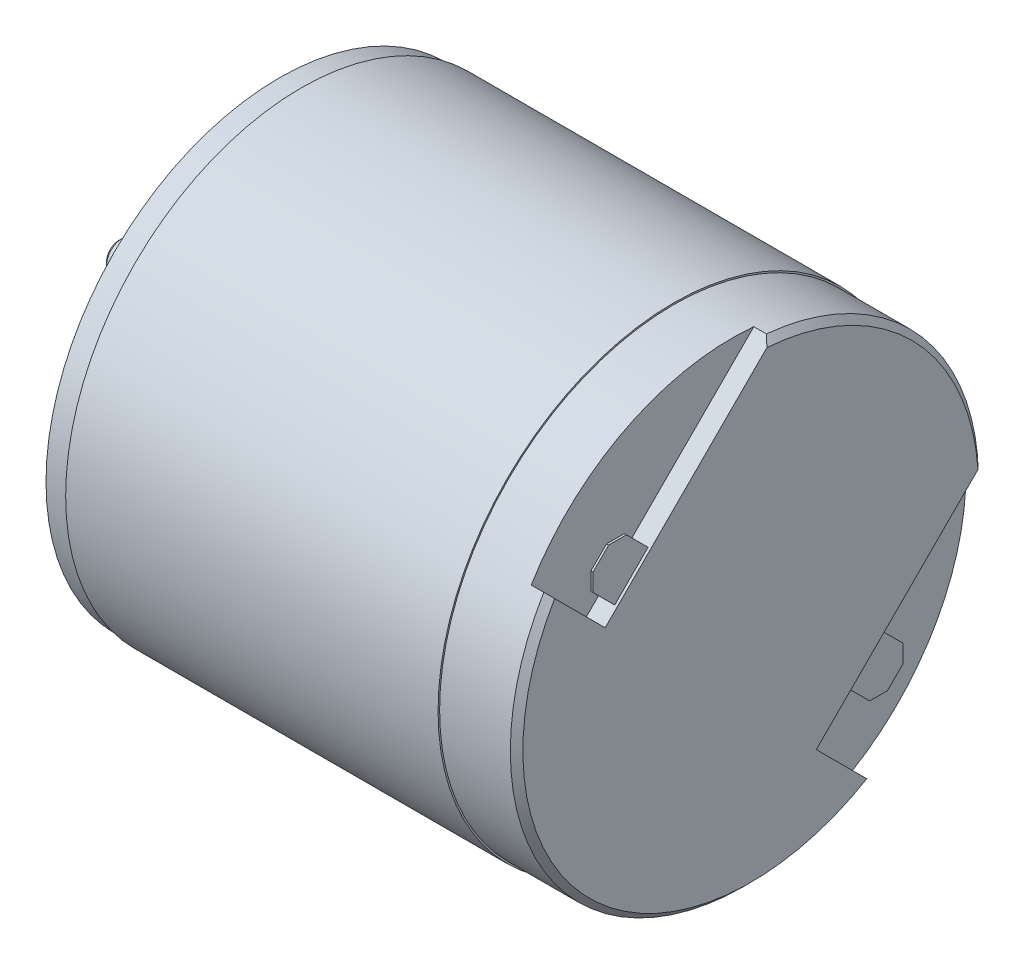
from build123d import *

# Parameters (mm, degrees)
ENL_V_START             = -1.2
ENL_V_MAT_EXTRU_2_DEPTH = 1.2
CHANFREIN1_SIZE         = 0.2
EXTRUSION1_DEPTH        = 0.13
CHANFREIN2_SIZE         = 0.8
CHANFREIN3_SIZE         = 0.4
CHANFREIN4_SIZE         = 0.2
CHANFREIN4_SIZE2        = 0.115470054


with BuildPart() as part:
    # Esquisse1 → R_volution1 (revolve)
    with BuildSketch(Plane.XY, mode=Mode.PRIVATE) as r_volution1_sk:
        Polygon((0, 0), (0, 14.9), (-4.9, 14.9), (-4.9, 15), (-28.6, 15), (-28.6, 14.85), (-30, 14.85), (-30, 4), (-30.9, 4), (-30.9, 2.1), (-32, 2.1), (-32, 1), (-40.2, 1), (-40.2, 0), align=None)
    revolve(r_volution1_sk.sketch.rotate(Axis((0, 0, 0), (1, 0, 0)), 90), axis=Axis((0, 0, 0), (1, 0, 0)))

    # Esquisse2 → Enl_v. mat.-Extru.2 (cut)
    with BuildSketch(Plane(origin=(0, 0, 0), x_dir=(0, 0, -1), z_dir=(1, 0, 0)).offset(ENL_V_START)):
        with BuildLine():
            Line((-9.263098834, 4.171930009), (1.399135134, 14.834163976))
            ThreePointArc((1.399135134, 14.834163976), (-6.717323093, 13.299908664), (-12.769331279, 7.678162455))
            Line((-12.769331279, 7.678162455), (-9.263098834, 4.171930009))
        make_face()
        with BuildLine():
            ThreePointArc((14.9, 0), (14.883531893, 0.700341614), (14.834163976, 1.399135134))
            Line((14.834163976, 1.399135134), (4.171930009, -9.263098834))
            Line((4.171930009, -9.263098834), (7.678162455, -12.769331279))
            ThreePointArc((7.678162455, -12.769331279), (12.969476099, -7.335031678), (14.9, 0))
        make_face()
    extrude(amount=ENL_V_MAT_EXTRU_2_DEPTH, mode=Mode.SUBTRACT)

    # Chanfrein1
    chanfrein1_edges = [part.edges().sort_by_distance(p)[0] for p in [
        (-40.2, 0, -1),
    ]]
    chamfer(chanfrein1_edges, length=CHANFREIN1_SIZE)

    # Esquisse3 → Extrusion1 (add)
    with BuildSketch(Plane(origin=(-0.3, 0, 0), x_dir=(0, 0, -1), z_dir=(1, 0, 0))):
        Polygon((-6.363961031, 7.071067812), (-8.308504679, 9.01561146), (-10.429825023, 6.894291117), (-8.485281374, 4.949747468), align=None)
        Polygon((8.485281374, -4.949747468), (6.363961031, -7.071067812), (8.308504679, -9.01561146), (10.429825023, -6.894291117), align=None)
    extrude(amount=EXTRUSION1_DEPTH)

    # Chanfrein2
    chanfrein2_edges = [part.edges().sort_by_distance(p)[0] for p in [
        (-0.235, 9.01561146, 8.308504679),
        (-0.235, 6.894291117, 10.429825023),
        (-0.235, -6.894291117, -10.429825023),
        (-0.235, -9.01561146, -8.308504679),
    ]]
    chamfer(chanfrein2_edges, length=CHANFREIN2_SIZE)

    # Chanfrein3
    chanfrein3_edges = [part.edges().sort_by_distance(p)[0] for p in [
        (0, 10.53589104, -10.53589104),
        (0, -12.969476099, 7.335031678),
    ]]
    chamfer(chanfrein3_edges, length=CHANFREIN3_SIZE)

    # Chanfrein4
    chanfrein4_edges = [part.edges().sort_by_distance(p)[0] for p in [
        (-32, 0, -2.1),
    ]]
    chanfrein4_side = [part.faces().sort_by_distance(p)[0] for p in [
        (-31.45, 0, -2.1),
    ]]
    chamfer(chanfrein4_edges, length=CHANFREIN4_SIZE, length2=CHANFREIN4_SIZE2, reference=chanfrein4_side[0])


solid = part.part
